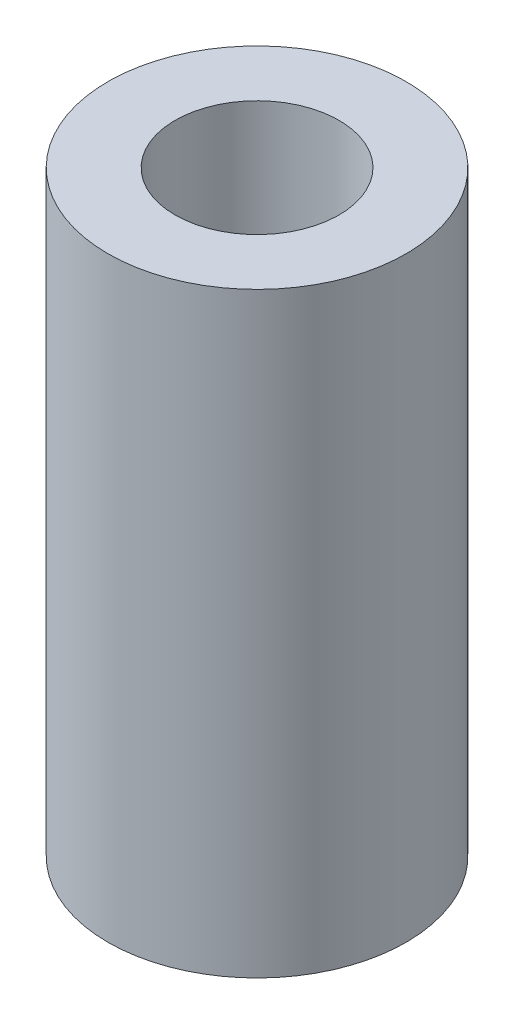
from build123d import *

# Parameters (mm, degrees)
SKETCH1_R           = 5
SKETCH1_R_2         = 2.75
BOSS_EXTRUDE1_DEPTH = 20


with BuildPart() as part:
    # Sketch1 → Boss-Extrude1 (new body)
    with BuildSketch(Plane(origin=(0, 0, 0), x_dir=(1, 0, 0), z_dir=(0, 1, 0))):
        with Locations(Location((0, 0, 0), (0, 0, 270))):
            Circle(SKETCH1_R)
        with Locations(Location((0, 0, 0), (0, 0, 270))):
            Circle(SKETCH1_R_2, mode=Mode.SUBTRACT)
    extrude(amount=BOSS_EXTRUDE1_DEPTH)


solid = part.part
